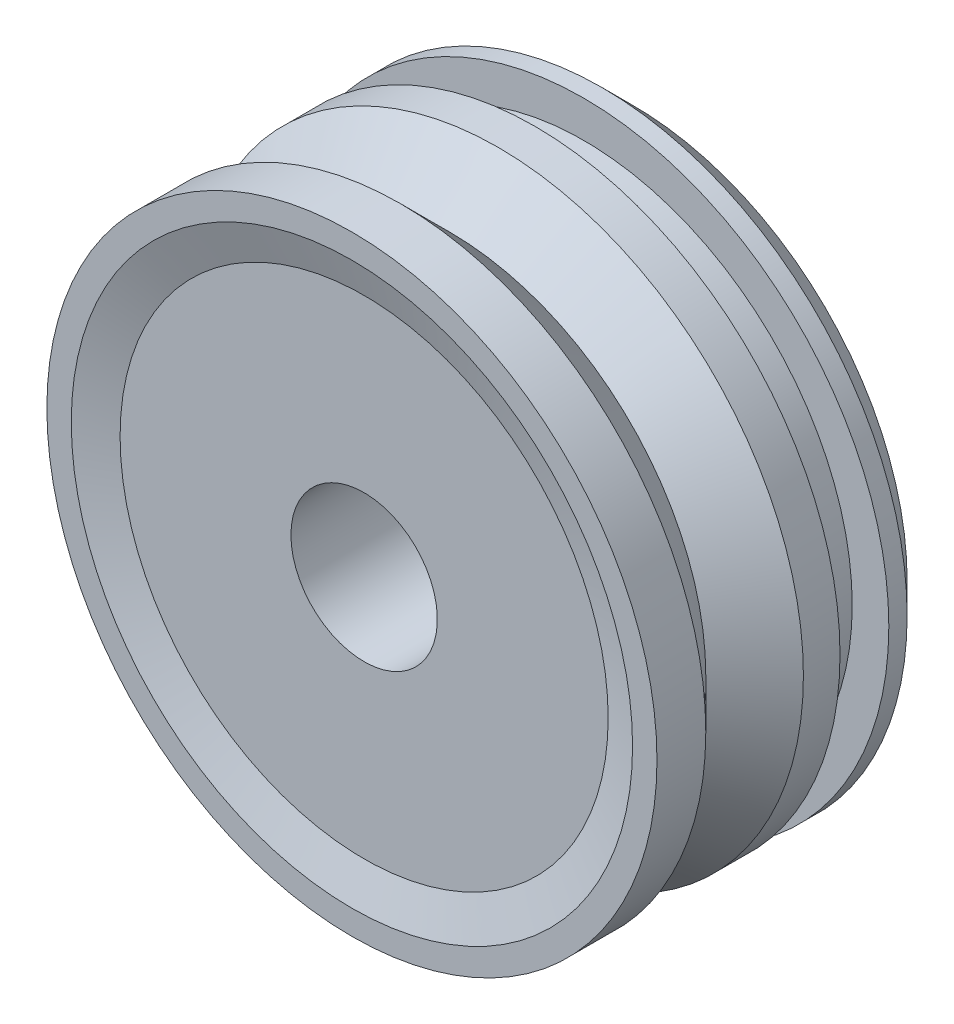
from build123d import *

# Parameters (mm, degrees)
ESQUISSE1_R             = 12.5
EXTRUSION1_DEPTH        = 11.5
ESQUISSE2_R             = 11.5
ESQUISSE3_R             = 10
CHANFREIN1_SIZE         = 1.25
ESQUISSE4_W             = 1.5
ESQUISSE4_H             = 2
ESQUISSE5_R             = 9.5
ESQUISSE5_R_2           = 6
ENL_V_MAT_EXTRU_1_DEPTH = 6
CHANFREIN2_SIZE         = 0.5
ESQUISSE6_R             = 3
ENL_V_MAT_EXTRU_2_DEPTH = 22.089096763


with BuildPart() as part:
    # Esquisse1 → Extrusion1 (new body)
    with BuildSketch(Plane.XY):
        with Locations(Location((0, 0, 0), (0, 0, 180))):
            Circle(ESQUISSE1_R)
    extrude(amount=EXTRUSION1_DEPTH)

    # Esquisse2 → Enl_vement de mati_re-Lissage1 section 0
    with BuildSketch(Plane.XY.offset(11.5)):
        Circle(ESQUISSE2_R)
    # Esquisse3 → Enl_vement de mati_re-Lissage1 section 1
    with BuildSketch(Plane.XY.offset(11)):
        Circle(ESQUISSE3_R)
    loft(mode=Mode.SUBTRACT)

    # Chanfrein1
    chanfrein1_edges = [part.edges().sort_by_distance(p)[0] for p in [
        (12.5, 0, 0),
    ]]
    chamfer(chanfrein1_edges, length=CHANFREIN1_SIZE)

    # Esquisse4 → Enl_vement de mati_re-R_volution1 (revolve, cut)
    with BuildSketch(Plane(origin=(0, 0, 0), x_dir=(1, 0, 0), z_dir=(0, 1, 0))):
        with Locations((-11.75, -3)):
            Rectangle(ESQUISSE4_W, ESQUISSE4_H)
        Polygon((-12.5, -5.5), (-12.5, -9.5), (-10.5, -7.5), align=None)
    revolve(axis=Axis((0, 0, -3.398653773), (0, 0, 1)), mode=Mode.SUBTRACT)

    # Esquisse5 → Enl_v. mat.-Extru.1 (cut)
    with BuildSketch(Plane(origin=(0, 0, 0), x_dir=(-1, 0, 0), z_dir=(0, 0, -1))):
        Circle(ESQUISSE5_R)
        Circle(ESQUISSE5_R_2, mode=Mode.SUBTRACT)
    extrude(amount=-ENL_V_MAT_EXTRU_1_DEPTH, mode=Mode.SUBTRACT)

    # Chanfrein2
    chanfrein2_edges = [part.edges().sort_by_distance(p)[0] for p in [
        (6, 0, 0),
    ]]
    chamfer(chanfrein2_edges, length=CHANFREIN2_SIZE)

    # Esquisse6 → Enl_v. mat.-Extru.2 (cut, through all)
    with BuildSketch(Plane(origin=(0, 0, 0), x_dir=(-1, 0, 0), z_dir=(0, 0, -1))):
        Circle(ESQUISSE6_R)
    extrude(amount=-ENL_V_MAT_EXTRU_2_DEPTH, mode=Mode.SUBTRACT)


solid = part.part
